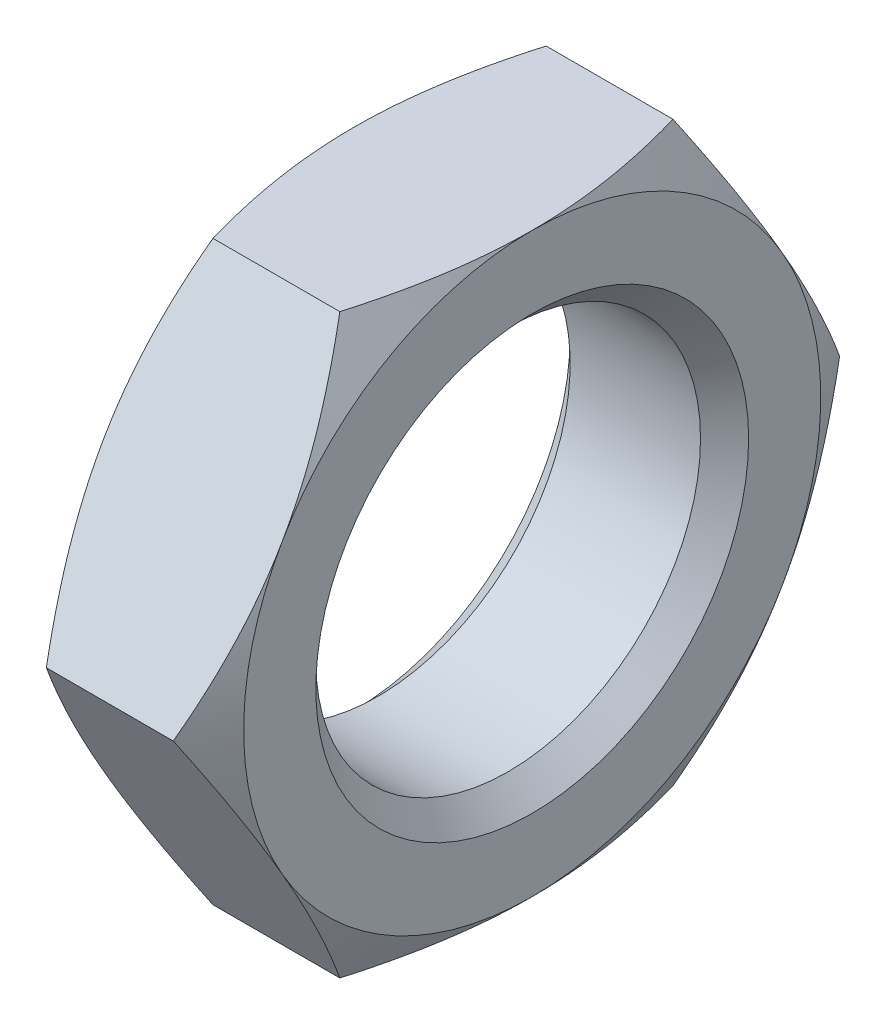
from build123d import *

# Parameters (mm, degrees)
SKETCH1_R      = 8
EXTRUDE1_DEPTH = 7.42
CHAMFER1_SIZE  = 1


with BuildPart() as part:
    # Sketch1 → Extrude1 (new body)
    with BuildSketch(Plane(origin=(0, 0, 0), x_dir=(0, 0, -1), z_dir=(1, 0, 0))):
        Polygon((6.92820323, 12), (-6.92820323, 12), (-13.856406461, 0), (-6.92820323, -12), (6.92820323, -12), (13.856406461, 0), align=None)
        with Locations(Location((0, 0, 0), (0, 0, 180))):
            Circle(SKETCH1_R, mode=Mode.SUBTRACT)
    extrude(amount=EXTRUDE1_DEPTH)

    # Sketch2 → Cut-Revolve1 (revolve, cut)
    with BuildSketch(Plane.XY):
        Polygon((7.42, 12), (7.42, 48), (0, 48), (0, 12), (3.71, 18.425908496), align=None)
    revolve(axis=Axis((7.42, 0, 0), (-1, 0, 0)), mode=Mode.SUBTRACT)

    # Chamfer1
    chamfer1_edges = [part.edges().sort_by_distance(p)[0] for p in [
        (0, 0, -8),
        (7.42, 0, -8),
    ]]
    chamfer(chamfer1_edges, length=CHAMFER1_SIZE)


solid = part.part
